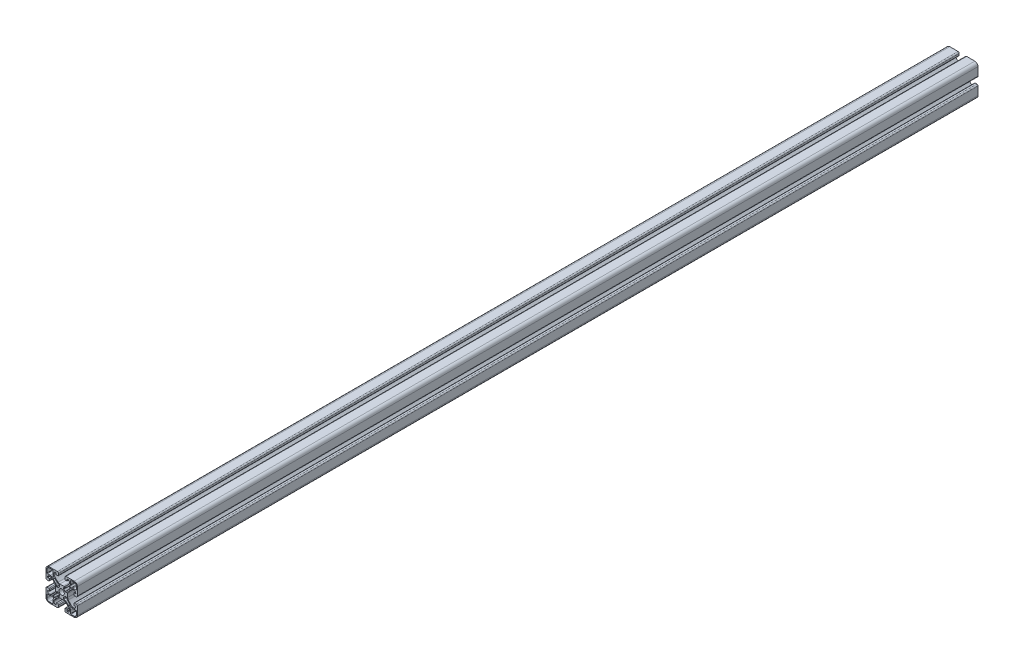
from build123d import *

# Parameters (mm, degrees)
ESQUISSE_PROFIL_R = 3.400000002
EXTRUSION1_DEPTH  = 1150


with BuildPart() as part:
    # Esquisse profil → Extrusion1 (new body)
    with BuildSketch(Plane.XY):
        with BuildLine():
            Line((5.500000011, -20), (15.999999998, -20))
            ThreePointArc((15.999999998, -20), (18.82842711, -18.82842713), (20, -16.000000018))
            Line((20, -16.000000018), (20, -5.500000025))
            ThreePointArc((20, -5.500000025), (19.560660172, -4.439339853), (18.5, -4.000000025))
            Line((18.5, -4.000000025), (16.5, -4.000000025))
            ThreePointArc((16.5, -4.000000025), (15.792893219, -4.292893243), (15.5, -5.000000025))
            Line((15.5, -5.000000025), (15.5, -6.750000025))
            ThreePointArc((15.5, -6.750000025), (15.573223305, -6.92677672), (15.75, -7.000000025))
            Line((15.75, -7.000000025), (17.75, -7.000000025))
            ThreePointArc((17.75, -7.000000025), (17.926776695, -7.073223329), (18, -7.250000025))
            Line((18, -7.250000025), (18, -7.500000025))
            ThreePointArc((18, -7.500000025), (17.267766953, -9.267766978), (15.5, -10.000000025))
            Line((15.5, -10.000000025), (14.72036024, -10.000000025))
            ThreePointArc((14.72036024, -10.000000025), (14.083793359, -9.895991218), (13.51343504, -9.594782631))
            ThreePointArc((13.51343504, -9.594782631), (10.848996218, -7.2640298), (8.540476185, -4.580305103))
            ThreePointArc((8.540476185, -4.580305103), (7.952757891, -3.450415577), (7.75, -2.193056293))
            Line((7.75, -2.193056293), (7.75, 2.193056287))
            ThreePointArc((7.75, 2.193056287), (7.952757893, 3.450415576), (8.54047619, 4.580305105))
            ThreePointArc((8.54047619, 4.580305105), (10.848996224, 7.264029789), (13.513435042, 9.594782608))
            ThreePointArc((13.513435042, 9.594782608), (14.083793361, 9.895991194), (14.72036024, 10))
            Line((14.72036024, 10), (15.5, 10))
            ThreePointArc((15.5, 10), (17.267766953, 9.267766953), (18, 7.5))
            Line((18, 7.5), (18, 7.25))
            ThreePointArc((18, 7.25), (17.926776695, 7.073223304), (17.75, 7))
            Line((17.75, 7), (15.75, 7))
            ThreePointArc((15.75, 7), (15.573223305, 6.926776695), (15.5, 6.75))
            Line((15.5, 6.75), (15.5, 5))
            ThreePointArc((15.5, 5), (15.792893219, 4.292893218), (16.5, 4))
            Line((16.5, 4), (18.5, 4))
            ThreePointArc((18.5, 4), (19.560660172, 4.439339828), (20, 5.5))
            Line((20, 5.5), (20, 16.000000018))
            ThreePointArc((20, 16.000000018), (18.828427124, 18.828427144), (15.999999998, 20))
            Line((15.999999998, 20), (5.500000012, 20))
            ThreePointArc((5.500000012, 20), (4.43933984, 19.560660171), (4.000000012, 18.5))
            Line((4.000000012, 18.5), (4.000000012, 16.5))
            ThreePointArc((4.000000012, 16.5), (4.292893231, 15.792893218), (5.000000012, 15.5))
            Line((5.000000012, 15.5), (6.750000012, 15.5))
            ThreePointArc((6.750000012, 15.5), (6.926776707, 15.573223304), (7.000000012, 15.75))
            Line((7.000000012, 15.75), (7.000000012, 17.75))
            ThreePointArc((7.000000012, 17.75), (7.073223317, 17.926776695), (7.250000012, 18))
            Line((7.250000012, 18), (7.500000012, 18))
            ThreePointArc((7.500000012, 18), (9.267766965, 17.267766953), (10.000000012, 15.5))
            Line((10.000000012, 15.5), (10.000000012, 14.72036024))
            ThreePointArc((10.000000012, 14.72036024), (9.895991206, 14.083793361), (9.594782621, 13.513435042))
            ThreePointArc((9.594782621, 13.513435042), (7.264029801, 10.848996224), (4.580305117, 8.540476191))
            ThreePointArc((4.580305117, 8.540476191), (3.450415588, 7.952757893), (2.193056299, 7.75))
            Line((2.193056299, 7.75), (-2.193056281, 7.75))
            ThreePointArc((-2.193056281, 7.75), (-3.45041557, 7.952757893), (-4.580305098, 8.54047619))
            ThreePointArc((-4.580305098, 8.54047619), (-7.264029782, 10.848996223), (-9.594782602, 13.513435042))
            ThreePointArc((-9.594782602, 13.513435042), (-9.895991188, 14.08379336), (-9.999999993, 14.72036024))
            Line((-9.999999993, 14.72036024), (-9.999999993, 15.5))
            ThreePointArc((-9.999999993, 15.5), (-9.267766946, 17.267766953), (-7.499999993, 18))
            Line((-7.499999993, 18), (-7.249999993, 18))
            ThreePointArc((-7.249999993, 18), (-7.073223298, 17.926776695), (-6.999999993, 17.75))
            Line((-6.999999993, 17.75), (-6.999999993, 15.75))
            ThreePointArc((-6.999999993, 15.75), (-6.926776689, 15.573223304), (-6.749999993, 15.5))
            Line((-6.749999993, 15.5), (-4.999999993, 15.5))
            ThreePointArc((-4.999999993, 15.5), (-4.292893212, 15.792893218), (-3.999999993, 16.5))
            Line((-3.999999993, 16.5), (-3.999999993, 18.5))
            ThreePointArc((-3.999999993, 18.5), (-4.439339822, 19.560660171), (-5.499999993, 20))
            Line((-5.499999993, 20), (-15.999999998, 20))
            ThreePointArc((-15.999999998, 20), (-18.82842711, 18.82842713), (-20, 16.000000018))
            Line((-20, 16.000000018), (-20, 5.499999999))
            ThreePointArc((-20, 5.499999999), (-19.560660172, 4.439339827), (-18.5, 3.999999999))
            Line((-18.5, 3.999999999), (-16.5, 3.999999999))
            ThreePointArc((-16.5, 3.999999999), (-15.792893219, 4.292893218), (-15.5, 4.999999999))
            Line((-15.5, 4.999999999), (-15.5, 6.749999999))
            ThreePointArc((-15.5, 6.749999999), (-15.573223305, 6.926776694), (-15.75, 6.999999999))
            Line((-15.75, 6.999999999), (-17.75, 6.999999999))
            ThreePointArc((-17.75, 6.999999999), (-17.926776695, 7.073223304), (-18, 7.249999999))
            Line((-18, 7.249999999), (-18, 7.499999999))
            ThreePointArc((-18, 7.499999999), (-17.267766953, 9.267766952), (-15.5, 9.999999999))
            Line((-15.5, 9.999999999), (-14.72036024, 9.999999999))
            ThreePointArc((-14.72036024, 9.999999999), (-14.083793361, 9.895991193), (-13.513435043, 9.594782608))
            ThreePointArc((-13.513435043, 9.594782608), (-10.848996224, 7.264029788), (-8.540476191, 4.580305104))
            ThreePointArc((-8.540476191, 4.580305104), (-7.952757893, 3.450415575), (-7.75, 2.193056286))
            Line((-7.75, 2.193056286), (-7.75, -2.193056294))
            ThreePointArc((-7.75, -2.193056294), (-7.952757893, -3.450415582), (-8.54047619, -4.580305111))
            ThreePointArc((-8.54047619, -4.580305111), (-10.848996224, -7.264029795), (-13.513435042, -9.594782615))
            ThreePointArc((-13.513435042, -9.594782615), (-14.083793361, -9.8959912), (-14.72036024, -10.000000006))
            Line((-14.72036024, -10.000000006), (-15.5, -10.000000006))
            ThreePointArc((-15.5, -10.000000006), (-17.267766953, -9.267766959), (-18, -7.500000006))
            Line((-18, -7.500000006), (-18, -7.250000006))
            ThreePointArc((-18, -7.250000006), (-17.926776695, -7.073223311), (-17.75, -7.000000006))
            Line((-17.75, -7.000000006), (-15.75, -7.000000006))
            ThreePointArc((-15.75, -7.000000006), (-15.573223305, -6.926776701), (-15.5, -6.750000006))
            Line((-15.5, -6.750000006), (-15.5, -5.000000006))
            ThreePointArc((-15.5, -5.000000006), (-15.792893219, -4.292893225), (-16.5, -4.000000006))
            Line((-16.5, -4.000000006), (-18.5, -4.000000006))
            ThreePointArc((-18.5, -4.000000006), (-19.560660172, -4.439339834), (-20, -5.500000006))
            Line((-20, -5.500000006), (-20, -15.999999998))
            ThreePointArc((-20, -15.999999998), (-18.828427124, -18.828427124), (-15.999999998, -20))
            Line((-15.999999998, -20), (-5.499999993, -20))
            ThreePointArc((-5.499999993, -20), (-4.439339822, -19.560660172), (-3.999999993, -18.5))
            Line((-3.999999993, -18.5), (-3.999999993, -16.5))
            ThreePointArc((-3.999999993, -16.5), (-4.292893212, -15.792893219), (-4.999999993, -15.5))
            Line((-4.999999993, -15.5), (-6.749999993, -15.5))
            ThreePointArc((-6.749999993, -15.5), (-6.926776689, -15.573223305), (-6.999999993, -15.75))
            Line((-6.999999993, -15.75), (-6.999999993, -17.75))
            ThreePointArc((-6.999999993, -17.75), (-7.073223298, -17.926776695), (-7.249999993, -18))
            Line((-7.249999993, -18), (-7.499999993, -18))
            ThreePointArc((-7.499999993, -18), (-9.267766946, -17.267766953), (-9.999999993, -15.5))
            Line((-9.999999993, -15.5), (-9.999999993, -14.72036024))
            ThreePointArc((-9.999999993, -14.72036024), (-9.895991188, -14.083793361), (-9.594782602, -13.513435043))
            ThreePointArc((-9.594782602, -13.513435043), (-7.264029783, -10.848996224), (-4.580305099, -8.540476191))
            ThreePointArc((-4.580305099, -8.540476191), (-3.45041557, -7.952757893), (-2.193056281, -7.75))
            Line((-2.193056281, -7.75), (2.193056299, -7.75))
            ThreePointArc((2.193056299, -7.75), (3.450415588, -7.952757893), (4.580305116, -8.54047619))
            ThreePointArc((4.580305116, -8.54047619), (7.264029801, -10.848996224), (9.59478262, -13.513435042))
            ThreePointArc((9.59478262, -13.513435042), (9.895991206, -14.083793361), (10.000000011, -14.72036024))
            Line((10.000000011, -14.72036024), (10.000000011, -15.5))
            ThreePointArc((10.000000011, -15.5), (9.267766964, -17.267766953), (7.500000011, -18))
            Line((7.500000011, -18), (7.250000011, -18))
            ThreePointArc((7.250000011, -18), (7.073223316, -17.926776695), (7.000000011, -17.75))
            Line((7.000000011, -17.75), (7.000000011, -15.75))
            ThreePointArc((7.000000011, -15.75), (6.926776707, -15.573223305), (6.750000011, -15.5))
            Line((6.750000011, -15.5), (5.000000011, -15.5))
            ThreePointArc((5.000000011, -15.5), (4.29289323, -15.792893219), (4.000000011, -16.5))
            Line((4.000000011, -16.5), (4.000000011, -18.5))
            ThreePointArc((4.000000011, -18.5), (4.43933984, -19.560660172), (5.500000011, -20))
        make_face()
        Circle(ESQUISSE_PROFIL_R, mode=Mode.SUBTRACT)
        with BuildLine():
            Line((11.699666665, 18.8), (15.999999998, 18.8))
            ThreePointArc((15.999999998, 18.8), (17.979898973, 17.979898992), (18.8, 16.000000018))
            Line((18.8, 16.000000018), (18.8, 11.699999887))
            ThreePointArc((18.8, 11.699999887), (18.653553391, 11.346446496), (18.3, 11.199999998))
            Line((18.3, 11.199999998), (14.670026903, 11.199999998))
            ThreePointArc((14.670026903, 11.199999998), (13.651519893, 11.033585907), (12.738946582, 10.551652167))
            Line((12.738946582, 10.551652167), (12.395722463, 10.287411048))
            ThreePointArc((12.395722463, 10.287411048), (12.057202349, 10.181979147), (11.733887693, 10.327510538))
            Line((11.733887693, 10.327510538), (10.327177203, 11.734221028))
            ThreePointArc((10.327177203, 11.734221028), (10.181645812, 12.057535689), (10.287077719, 12.396055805))
            Line((10.287077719, 12.396055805), (10.551318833, 12.739279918))
            ThreePointArc((10.551318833, 12.739279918), (11.033252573, 13.651853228), (11.199666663, 14.670360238))
            Line((11.199666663, 14.670360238), (11.199666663, 18.299999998))
            ThreePointArc((11.199666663, 18.299999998), (11.346113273, 18.65355339), (11.699666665, 18.8))
        make_face(mode=Mode.SUBTRACT)
        with BuildLine():
            Line((-11.199666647, 14.669919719), (-11.199666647, 18.299999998))
            ThreePointArc((-11.199666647, 18.299999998), (-11.346113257, 18.65355339), (-11.699666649, 18.8))
            Line((-11.699666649, 18.8), (-15.999999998, 18.8))
            ThreePointArc((-15.999999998, 18.8), (-17.979898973, 17.979898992), (-18.8, 16.000000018))
            Line((-18.8, 16.000000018), (-18.8, 11.699999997))
            ThreePointArc((-18.8, 11.699999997), (-18.653553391, 11.346446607), (-18.3, 11.199999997))
            Line((-18.3, 11.199999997), (-14.67036024, 11.199999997))
            ThreePointArc((-14.67036024, 11.199999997), (-13.65185323, 11.033585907), (-12.739279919, 10.551652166))
            Line((-12.739279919, 10.551652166), (-12.3960558, 10.287411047))
            ThreePointArc((-12.3960558, 10.287411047), (-12.057535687, 10.181979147), (-11.73422103, 10.327510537))
            Line((-11.73422103, 10.327510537), (-10.32751054, 11.734221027))
            ThreePointArc((-10.32751054, 11.734221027), (-10.181979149, 12.057535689), (-10.287411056, 12.396055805))
            Line((-10.287411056, 12.396055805), (-10.551651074, 12.739278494))
            ThreePointArc((-10.551651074, 12.739278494), (-11.033340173, 13.651673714), (-11.199666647, 14.669919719))
        make_face(mode=Mode.SUBTRACT)
        with BuildLine():
            Line((-2.500000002, 6.098239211), (-2.500000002, 4.609772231))
            ThreePointArc((-2.500000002, 4.609772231), (-2.560475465, 4.371406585), (-2.727272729, 4.19070203))
            ThreePointArc((-2.727272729, 4.19070203), (-3.535533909, 3.535533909), (-4.19070203, 2.727272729))
            ThreePointArc((-4.19070203, 2.727272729), (-4.371406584, 2.560475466), (-4.609772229, 2.500000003))
            Line((-4.609772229, 2.500000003), (-6.098239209, 2.500000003))
            ThreePointArc((-6.098239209, 2.500000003), (-6.428045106, 2.62419677), (-6.594007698, 2.935087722))
            ThreePointArc((-6.594007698, 2.935087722), (-6.934262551, 4.221803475), (-7.589999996, 5.380000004))
            ThreePointArc((-7.589999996, 5.380000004), (-9.089852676, 7.202595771), (-10.747651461, 8.882809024))
            ThreePointArc((-10.747651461, 8.882809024), (-10.907820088, 9.24007063), (-10.761465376, 9.603209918))
            Line((-10.761465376, 9.603209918), (-9.603209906, 10.761465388))
            ThreePointArc((-9.603209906, 10.761465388), (-9.240070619, 10.907820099), (-8.882809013, 10.747651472))
            ThreePointArc((-8.882809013, 10.747651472), (-7.202595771, 9.089852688), (-5.380000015, 7.590000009))
            ThreePointArc((-5.380000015, 7.590000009), (-4.221803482, 6.934262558), (-2.935087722, 6.594007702))
            ThreePointArc((-2.935087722, 6.594007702), (-2.624196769, 6.428045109), (-2.500000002, 6.098239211))
        make_face(mode=Mode.SUBTRACT)
        with BuildLine():
            Line((-10.761465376, -9.603209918), (-9.603209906, -10.761465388))
            ThreePointArc((-9.603209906, -10.761465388), (-9.240070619, -10.907820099), (-8.882809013, -10.747651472))
            ThreePointArc((-8.882809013, -10.747651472), (-7.202595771, -9.089852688), (-5.380000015, -7.590000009))
            ThreePointArc((-5.380000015, -7.590000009), (-4.221803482, -6.934262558), (-2.935087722, -6.594007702))
            ThreePointArc((-2.935087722, -6.594007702), (-2.624196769, -6.428045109), (-2.500000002, -6.098239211))
            Line((-2.500000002, -6.098239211), (-2.500000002, -4.609772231))
            ThreePointArc((-2.500000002, -4.609772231), (-2.560475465, -4.371406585), (-2.727272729, -4.19070203))
            ThreePointArc((-2.727272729, -4.19070203), (-3.535533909, -3.535533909), (-4.19070203, -2.727272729))
            ThreePointArc((-4.19070203, -2.727272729), (-4.371406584, -2.560475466), (-4.609772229, -2.500000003))
            Line((-4.609772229, -2.500000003), (-6.098239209, -2.500000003))
            ThreePointArc((-6.098239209, -2.500000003), (-6.428045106, -2.62419677), (-6.594007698, -2.935087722))
            ThreePointArc((-6.594007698, -2.935087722), (-6.934262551, -4.221803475), (-7.589999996, -5.380000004))
            ThreePointArc((-7.589999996, -5.380000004), (-9.089852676, -7.202595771), (-10.747651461, -8.882809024))
            ThreePointArc((-10.747651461, -8.882809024), (-10.907820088, -9.24007063), (-10.761465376, -9.603209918))
        make_face(mode=Mode.SUBTRACT)
        with BuildLine():
            Line((-11.699999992, -18.8), (-15.999999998, -18.8))
            ThreePointArc((-15.999999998, -18.8), (-17.979898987, -17.979898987), (-18.8, -15.999999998))
            Line((-18.8, -15.999999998), (-18.8, -11.700000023))
            ThreePointArc((-18.8, -11.700000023), (-18.653553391, -11.346446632), (-18.3, -11.200000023))
            Line((-18.3, -11.200000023), (-14.67036024, -11.200000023))
            ThreePointArc((-14.67036024, -11.200000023), (-13.65185323, -11.033585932), (-12.739279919, -10.551652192))
            Line((-12.739279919, -10.551652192), (-12.3960558, -10.287411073))
            ThreePointArc((-12.3960558, -10.287411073), (-12.057535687, -10.181979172), (-11.73422103, -10.327510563))
            Line((-11.73422103, -10.327510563), (-10.32751054, -11.734221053))
            ThreePointArc((-10.32751054, -11.734221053), (-10.181979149, -12.057535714), (-10.287411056, -12.39605583))
            Line((-10.287411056, -12.39605583), (-10.55165217, -12.739279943))
            ThreePointArc((-10.55165217, -12.739279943), (-11.033585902, -13.651853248), (-11.19999999, -14.670360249))
            Line((-11.19999999, -14.670360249), (-11.19999999, -18.299999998))
            ThreePointArc((-11.19999999, -18.299999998), (-11.3464466, -18.65355339), (-11.699999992, -18.8))
        make_face(mode=Mode.SUBTRACT)
        with BuildLine():
            Line((9.603209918, 10.761465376), (10.761465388, 9.603209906))
            ThreePointArc((10.761465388, 9.603209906), (10.907820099, 9.240070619), (10.747651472, 8.882809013))
            ThreePointArc((10.747651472, 8.882809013), (9.089852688, 7.202595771), (7.590000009, 5.380000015))
            ThreePointArc((7.590000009, 5.380000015), (6.934262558, 4.221803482), (6.594007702, 2.935087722))
            ThreePointArc((6.594007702, 2.935087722), (6.428045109, 2.624196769), (6.098239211, 2.500000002))
            Line((6.098239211, 2.500000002), (4.609772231, 2.500000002))
            ThreePointArc((4.609772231, 2.500000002), (4.371406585, 2.560475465), (4.19070203, 2.727272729))
            ThreePointArc((4.19070203, 2.727272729), (3.535533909, 3.535533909), (2.727272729, 4.19070203))
            ThreePointArc((2.727272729, 4.19070203), (2.560475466, 4.371406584), (2.500000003, 4.609772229))
            Line((2.500000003, 4.609772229), (2.500000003, 6.098239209))
            ThreePointArc((2.500000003, 6.098239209), (2.62419677, 6.428045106), (2.935087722, 6.594007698))
            ThreePointArc((2.935087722, 6.594007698), (4.221803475, 6.934262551), (5.380000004, 7.589999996))
            ThreePointArc((5.380000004, 7.589999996), (7.202595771, 9.089852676), (8.882809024, 10.747651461))
            ThreePointArc((8.882809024, 10.747651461), (9.24007063, 10.907820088), (9.603209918, 10.761465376))
        make_face(mode=Mode.SUBTRACT)
        with BuildLine():
            Line((2.500000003, -4.609772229), (2.500000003, -6.098239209))
            ThreePointArc((2.500000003, -6.098239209), (2.62419677, -6.428045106), (2.935087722, -6.594007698))
            ThreePointArc((2.935087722, -6.594007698), (4.221803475, -6.934262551), (5.380000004, -7.589999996))
            ThreePointArc((5.380000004, -7.589999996), (7.202595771, -9.089852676), (8.882809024, -10.747651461))
            ThreePointArc((8.882809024, -10.747651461), (9.24007063, -10.907820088), (9.603209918, -10.761465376))
            Line((9.603209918, -10.761465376), (10.761465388, -9.603209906))
            ThreePointArc((10.761465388, -9.603209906), (10.907820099, -9.240070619), (10.747651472, -8.882809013))
            ThreePointArc((10.747651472, -8.882809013), (9.089852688, -7.202595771), (7.590000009, -5.380000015))
            ThreePointArc((7.590000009, -5.380000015), (6.934262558, -4.221803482), (6.594007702, -2.935087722))
            ThreePointArc((6.594007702, -2.935087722), (6.428045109, -2.624196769), (6.098239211, -2.500000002))
            Line((6.098239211, -2.500000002), (4.609772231, -2.500000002))
            ThreePointArc((4.609772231, -2.500000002), (4.371406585, -2.560475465), (4.19070203, -2.727272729))
            ThreePointArc((4.19070203, -2.727272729), (3.535533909, -3.535533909), (2.727272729, -4.19070203))
            ThreePointArc((2.727272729, -4.19070203), (2.560475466, -4.371406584), (2.500000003, -4.609772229))
        make_face(mode=Mode.SUBTRACT)
        with BuildLine():
            Line((11.199666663, -14.670360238), (11.199666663, -18.299999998))
            ThreePointArc((11.199666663, -18.299999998), (11.346113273, -18.65355339), (11.699666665, -18.8))
            Line((11.699666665, -18.8), (15.999999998, -18.8))
            ThreePointArc((15.999999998, -18.8), (17.979898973, -17.979898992), (18.8, -16.000000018))
            Line((18.8, -16.000000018), (18.8, -11.699999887))
            ThreePointArc((18.8, -11.699999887), (18.653553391, -11.346446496), (18.3, -11.199999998))
            Line((18.3, -11.199999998), (14.670026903, -11.199999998))
            ThreePointArc((14.670026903, -11.199999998), (13.651519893, -11.033585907), (12.738946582, -10.551652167))
            Line((12.738946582, -10.551652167), (12.395722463, -10.287411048))
            ThreePointArc((12.395722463, -10.287411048), (12.057202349, -10.181979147), (11.733887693, -10.327510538))
            Line((11.733887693, -10.327510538), (10.327177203, -11.734221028))
            ThreePointArc((10.327177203, -11.734221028), (10.181645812, -12.057535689), (10.287077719, -12.396055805))
            Line((10.287077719, -12.396055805), (10.551318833, -12.739279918))
            ThreePointArc((10.551318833, -12.739279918), (11.033252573, -13.651853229), (11.199666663, -14.670360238))
        make_face(mode=Mode.SUBTRACT)
    extrude(amount=EXTRUSION1_DEPTH)


solid = part.part
